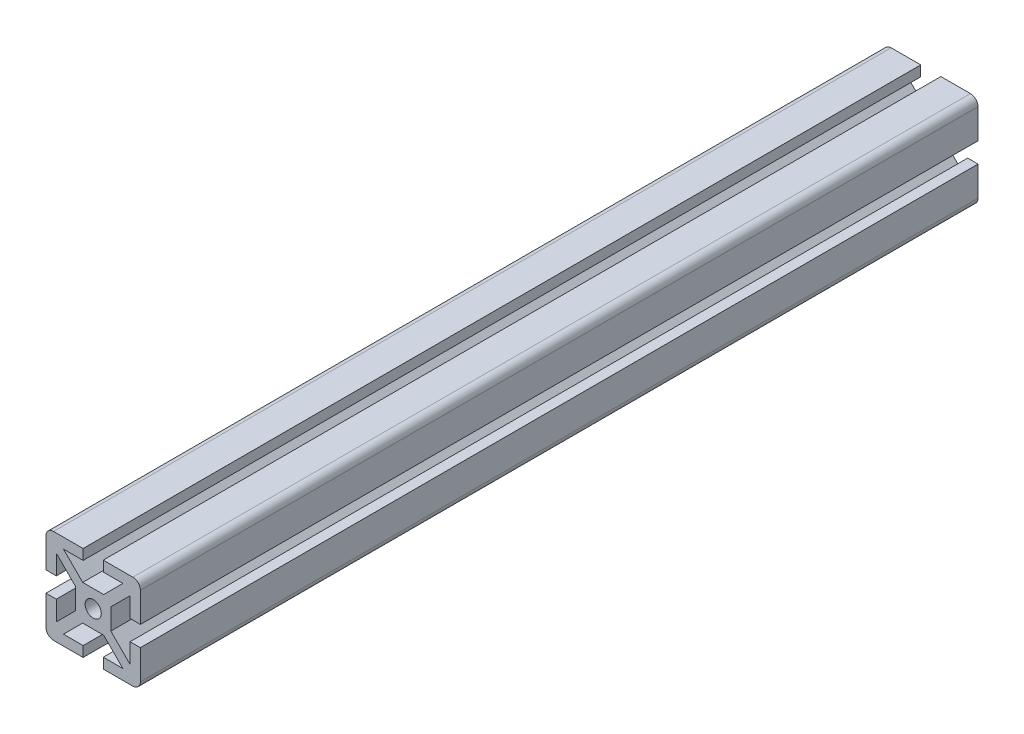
from build123d import *

# Parameters (mm, degrees)
SKETCH1_R      = 3.2639
FINALCUT_DEPTH = 338.1375


with BuildPart() as part:
    # Sketch1 → FinalCut (new body)
    with BuildSketch(Plane.XY):
        with BuildLine():
            Line((-7.112, 0), (-7.112, 4.238318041))
            Line((-7.112, 4.238318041), (-14.8844, 12.010718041))
            Line((-14.8844, 12.010718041), (-14.8844, 4.064))
            Line((-14.8844, 4.064), (-19.05, 4.064))
            Line((-19.05, 4.064), (-19.05, 16.002))
            ThreePointArc((-19.05, 16.002), (-18.157261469, 18.157261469), (-16.002, 19.05))
            Line((-16.002, 19.05), (-4.064, 19.05))
            Line((-4.064, 19.05), (-4.064, 14.8844))
            Line((-4.064, 14.8844), (-12.010718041, 14.8844))
            Line((-12.010718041, 14.8844), (-4.238318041, 7.112))
            Line((-4.238318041, 7.112), (0, 7.112))
            Line((0, 7.112), (4.238318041, 7.112))
            Line((4.238318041, 7.112), (12.010718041, 14.8844))
            Line((12.010718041, 14.8844), (4.064, 14.8844))
            Line((4.064, 14.8844), (4.064, 19.05))
            Line((4.064, 19.05), (16.002, 19.05))
            ThreePointArc((16.002, 19.05), (18.157261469, 18.157261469), (19.05, 16.002))
            Line((19.05, 16.002), (19.05, 4.064))
            Line((19.05, 4.064), (14.8844, 4.064))
            Line((14.8844, 4.064), (14.8844, 12.010718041))
            Line((14.8844, 12.010718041), (7.112, 4.238318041))
            Line((7.112, 4.238318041), (7.112, 0))
            Line((7.112, 0), (7.112, -4.238318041))
            Line((7.112, -4.238318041), (14.8844, -12.010718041))
            Line((14.8844, -12.010718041), (14.8844, -4.064))
            Line((14.8844, -4.064), (19.05, -4.064))
            Line((19.05, -4.064), (19.05, -16.002))
            ThreePointArc((19.05, -16.002), (18.157261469, -18.157261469), (16.002, -19.05))
            Line((16.002, -19.05), (4.064, -19.05))
            Line((4.064, -19.05), (4.064, -14.8844))
            Line((4.064, -14.8844), (12.010718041, -14.8844))
            Line((12.010718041, -14.8844), (4.238318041, -7.112))
            Line((4.238318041, -7.112), (0, -7.112))
            Line((0, -7.112), (-4.238318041, -7.112))
            Line((-4.238318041, -7.112), (-12.010718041, -14.8844))
            Line((-12.010718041, -14.8844), (-4.064, -14.8844))
            Line((-4.064, -14.8844), (-4.064, -19.05))
            Line((-4.064, -19.05), (-16.002, -19.05))
            ThreePointArc((-16.002, -19.05), (-18.157261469, -18.157261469), (-19.05, -16.002))
            Line((-19.05, -16.002), (-19.05, -4.064))
            Line((-19.05, -4.064), (-14.8844, -4.064))
            Line((-14.8844, -4.064), (-14.8844, -12.010718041))
            Line((-14.8844, -12.010718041), (-7.112, -4.238318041))
            Line((-7.112, -4.238318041), (-7.112, 0))
        make_face()
        Circle(SKETCH1_R, mode=Mode.SUBTRACT)
    extrude(amount=-FINALCUT_DEPTH)


solid = part.part
